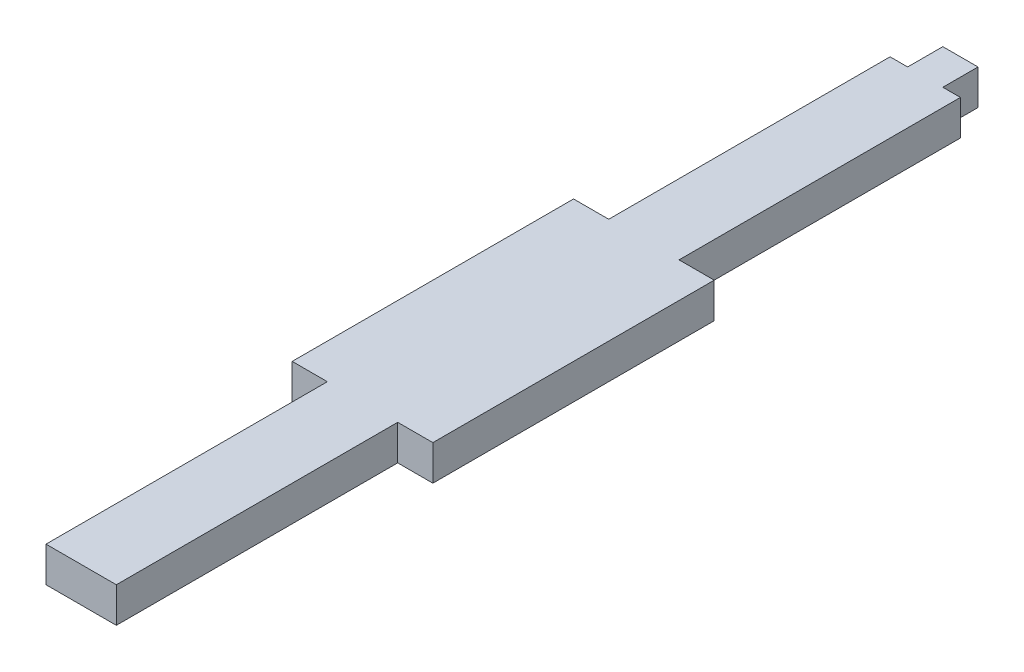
from build123d import *

# Parameters (mm, degrees)
BOSS_EXTRUDE1_DEPTH = 3.175


with BuildPart() as part:
    # Sketch1 → Boss-Extrude1 (new body)
    with BuildSketch(Plane(origin=(0, 0, 0), x_dir=(1, 0, 0), z_dir=(0, 1, 0))):
        Polygon((6.35, -53.975), (6.35, -28.575), (3.175, -28.575), (3.175, -3.175), (1.5875, -3.175), (1.5875, 0), (0, 0), (-1.5875, 0), (-1.5875, -3.175), (-3.175, -3.175), (-3.175, -28.575), (-6.35, -28.575), (-6.35, -53.975), (-3.175, -53.975), (-3.175, -79.375), (3.175, -79.375), (3.175, -53.975), align=None)
    extrude(amount=BOSS_EXTRUDE1_DEPTH)


solid = part.part
